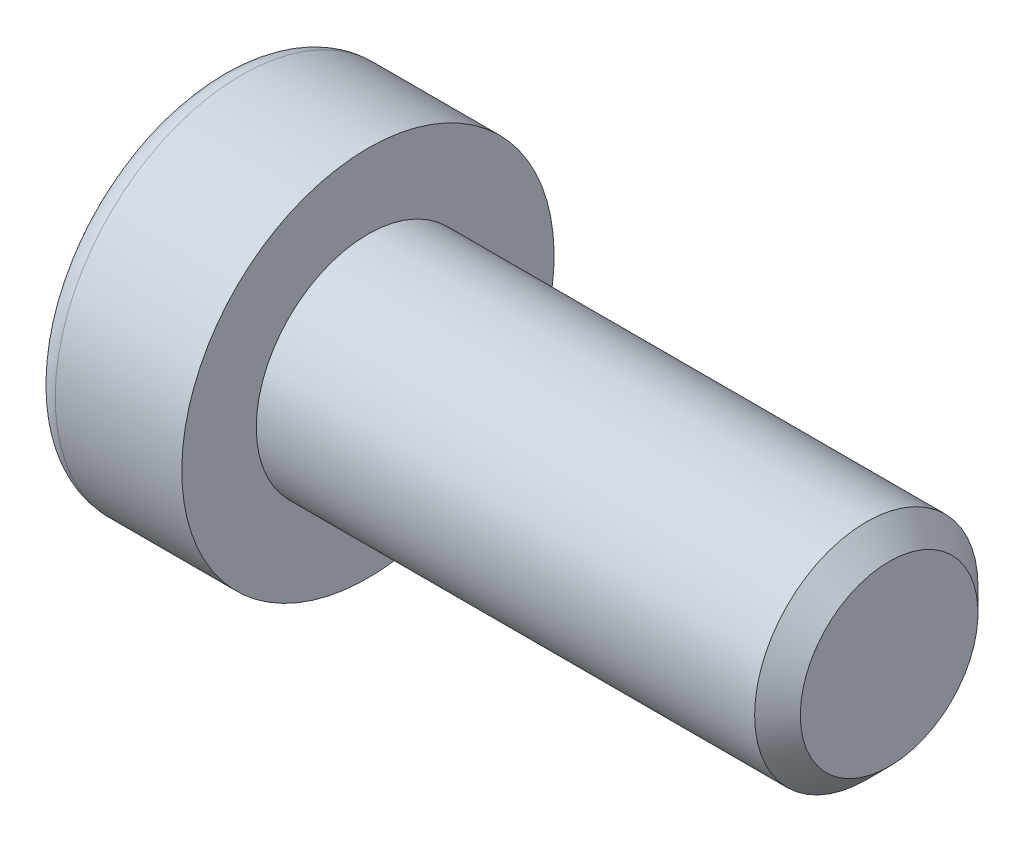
ISO-10303-21;
HEADER;
FILE_DESCRIPTION(('STEP AP214'),'2;1');
FILE_NAME('part.step','',(''),(''),'','','');
FILE_SCHEMA(('AUTOMOTIVE_DESIGN { 1 0 10303 214 1 1 1 1 }'));
ENDSEC;
DATA;
#1=APPLICATION_CONTEXT('core data for automotive mechanical design processes');
#2=APPLICATION_PROTOCOL_DEFINITION('international standard','automotive_design',2000,#1);
#3=PRODUCT_CONTEXT('',#1,'mechanical');
#4=PRODUCT('Part','Part','',(#3));
#5=PRODUCT_RELATED_PRODUCT_CATEGORY('part','',(#4));
#6=PRODUCT_DEFINITION_FORMATION('','',#4);
#7=PRODUCT_DEFINITION_CONTEXT('part definition',#1,'design');
#8=PRODUCT_DEFINITION('design','',#6,#7);
#9=PRODUCT_DEFINITION_SHAPE('','',#8);
#10=(LENGTH_UNIT() NAMED_UNIT(*) SI_UNIT(.MILLI.,.METRE.));
#11=(NAMED_UNIT(*) PLANE_ANGLE_UNIT() SI_UNIT($,.RADIAN.));
#12=(NAMED_UNIT(*) SI_UNIT($,.STERADIAN.) SOLID_ANGLE_UNIT());
#13=UNCERTAINTY_MEASURE_WITH_UNIT(LENGTH_MEASURE(1.E-05),#10,'distance_accuracy_value','');
#14=(GEOMETRIC_REPRESENTATION_CONTEXT(3) GLOBAL_UNCERTAINTY_ASSIGNED_CONTEXT((#13)) GLOBAL_UNIT_ASSIGNED_CONTEXT((#10,
#11,#12)) REPRESENTATION_CONTEXT('',''));
#15=CARTESIAN_POINT('',(0.,0.,0.));
#16=DIRECTION('',(0.,0.,1.));
#17=DIRECTION('',(1.,0.,0.));
#18=AXIS2_PLACEMENT_3D('',#15,#16,#17);
#19=CARTESIAN_POINT('',(-1.00800000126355,0.,0.));
#20=DIRECTION('',(-1.,0.,0.));
#21=DIRECTION('',(0.,0.,1.));
#22=AXIS2_PLACEMENT_3D('',#19,#20,#21);
#23=CONICAL_SURFACE('',#22,2.32325748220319,1.04719754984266);
#24=CARTESIAN_POINT('',(0.333333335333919,-2.27373675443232E-10,0.));
#25=VERTEX_POINT('',#24);
#26=VERTEX_LOOP('',#25);
#27=FACE_BOUND('',#26,.T.);
#28=CARTESIAN_POINT('',(-1.00000000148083,2.00000000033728,1.15470053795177));
#29=CARTESIAN_POINT('',(-0.970695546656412,2.00000000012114,1.05321634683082));
#30=CARTESIAN_POINT('',(-0.944044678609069,2.00000000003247,0.950856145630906));
#31=CARTESIAN_POINT('',(-0.897526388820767,1.99999999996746,0.744363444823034));
#32=CARTESIAN_POINT('',(-0.877675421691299,1.99999999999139,0.640227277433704));
#33=CARTESIAN_POINT('',(-0.84677596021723,2.0000000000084,0.43324544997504));
#34=CARTESIAN_POINT('',(-0.835521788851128,2.00000000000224,0.330431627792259));
#35=CARTESIAN_POINT('',(-0.822089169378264,1.99999999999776,0.124320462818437));
#36=CARTESIAN_POINT('',(-0.819899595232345,1.99999999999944,0.0210238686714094));
#37=CARTESIAN_POINT('',(-0.824466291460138,2.00000000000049,-0.171974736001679));
#38=CARTESIAN_POINT('',(-0.830101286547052,2.00000000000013,-0.261705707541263));
#39=CARTESIAN_POINT('',(-0.847957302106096,1.99999999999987,-0.440583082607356));
#40=CARTESIAN_POINT('',(-0.86018441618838,1.99999999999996,-0.529728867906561));
#41=CARTESIAN_POINT('',(-0.890749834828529,2.00000000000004,-0.708974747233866));
#42=CARTESIAN_POINT('',(-0.909217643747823,2.00000000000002,-0.799052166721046));
#43=CARTESIAN_POINT('',(-0.95113176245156,1.99999999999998,-0.977863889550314));
#44=CARTESIAN_POINT('',(-0.974568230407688,1.99999999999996,-1.06660048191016));
#45=CARTESIAN_POINT('',(-1.00000000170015,2.,-1.15470053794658));
#46=B_SPLINE_CURVE_WITH_KNOTS('',3,(#28,#29,#30,#31,#32,#33,#34,#35,#36,#37,#38,#39,#40,#41,#42,
#43,#44,#45),.UNSPECIFIED.,.F.,.F.,(4,2,2,2,2,2,2,2,4),(0.,0.317016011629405,0.634793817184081,
0.944707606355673,1.25424088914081,1.52370778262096,1.79342419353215,2.06912162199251,
2.34427797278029),.UNSPECIFIED.);
#47=CARTESIAN_POINT('',(-1.00000000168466,1.99999999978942,1.15470053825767));
#48=VERTEX_POINT('',#47);
#49=CARTESIAN_POINT('',(-1.00000000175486,2.,-1.15470053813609));
#50=VERTEX_POINT('',#49);
#51=EDGE_CURVE('E20',#48,#50,#46,.T.);
#52=ORIENTED_EDGE('',*,*,#51,.T.);
#53=CARTESIAN_POINT('',(-1.00000000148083,1.99999999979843,-1.15470053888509));
#54=CARTESIAN_POINT('',(-0.970695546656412,1.91211211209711,-1.20544263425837));
#55=CARTESIAN_POINT('',(-0.94404467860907,1.82346557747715,-1.25662273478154));
#56=CARTESIAN_POINT('',(-0.897526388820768,1.64463765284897,-1.35986908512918));
#57=CARTESIAN_POINT('',(-0.877675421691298,1.55445308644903,-1.41193716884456));
#58=CARTESIAN_POINT('',(-0.84677596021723,1.37520156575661,-1.51542808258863));
#59=CARTESIAN_POINT('',(-0.835521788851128,1.28616218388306,-1.56683499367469));
#60=CARTESIAN_POINT('',(-0.822089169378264,1.10766467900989,-1.66989057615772));
#61=CARTESIAN_POINT('',(-0.819899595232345,1.01820720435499,-1.72153887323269));
#62=CARTESIAN_POINT('',(-0.824466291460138,0.851065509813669,-1.81803817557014));
#63=CARTESIAN_POINT('',(-0.830101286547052,0.773356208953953,-1.86290366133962));
#64=CARTESIAN_POINT('',(-0.847957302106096,0.618443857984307,-1.95234234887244));
#65=CARTESIAN_POINT('',(-0.860184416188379,0.541241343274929,-1.99691524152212));
#66=CARTESIAN_POINT('',(-0.890749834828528,0.386009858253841,-2.08653818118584));
#67=CARTESIAN_POINT('',(-0.909217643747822,0.308000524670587,-2.13157689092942));
#68=CARTESIAN_POINT('',(-0.95113176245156,0.153145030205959,-2.22098275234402));
#69=CARTESIAN_POINT('',(-0.974568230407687,0.076296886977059,-2.26535104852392));
#70=CARTESIAN_POINT('',(-1.00000000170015,3.74709208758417E-10,-2.30940107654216));
#71=B_SPLINE_CURVE_WITH_KNOTS('',3,(#53,#54,#55,#56,#57,#58,#59,#60,#61,#62,#63,#64,#65,#66,#67,
#68,#69,#70),.UNSPECIFIED.,.F.,.F.,(4,2,2,2,2,2,2,2,4),(0.,0.317016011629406,0.634793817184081,
0.944707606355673,1.25424088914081,1.52370778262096,1.79342419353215,2.06912162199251,
2.34427797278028),.UNSPECIFIED.);
#72=CARTESIAN_POINT('',(-1.00000000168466,0.,-2.30940107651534));
#73=VERTEX_POINT('',#72);
#74=EDGE_CURVE('E81',#50,#73,#71,.T.);
#75=ORIENTED_EDGE('',*,*,#74,.T.);
#76=CARTESIAN_POINT('',(-1.00000000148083,-5.38850513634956E-10,-2.30940107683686));
#77=CARTESIAN_POINT('',(-0.970695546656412,-0.0878878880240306,-2.2586589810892));
#78=CARTESIAN_POINT('',(-0.944044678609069,-0.176534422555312,-2.20747888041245));
#79=CARTESIAN_POINT('',(-0.897526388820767,-0.355362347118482,-2.10423252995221));
#80=CARTESIAN_POINT('',(-0.877675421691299,-0.445546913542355,-2.05216444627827));
#81=CARTESIAN_POINT('',(-0.84677596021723,-0.624798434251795,-1.94867353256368));
#82=CARTESIAN_POINT('',(-0.835521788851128,-0.713837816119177,-1.89726662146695));
#83=CARTESIAN_POINT('',(-0.822089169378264,-0.892335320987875,-1.79421103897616));
#84=CARTESIAN_POINT('',(-0.819899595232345,-0.981792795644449,-1.7425627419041));
#85=CARTESIAN_POINT('',(-0.824466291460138,-1.14893449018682,-1.64606343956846));
#86=CARTESIAN_POINT('',(-0.830101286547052,-1.22664379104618,-1.60119795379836));
#87=CARTESIAN_POINT('',(-0.847957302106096,-1.38155614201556,-1.51175926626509));
#88=CARTESIAN_POINT('',(-0.860184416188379,-1.45875865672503,-1.46718637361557));
#89=CARTESIAN_POINT('',(-0.890749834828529,-1.6139901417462,-1.37756343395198));
#90=CARTESIAN_POINT('',(-0.909217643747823,-1.69199947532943,-1.33252472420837));
#91=CARTESIAN_POINT('',(-0.95113176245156,-1.84685496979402,-1.2431188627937));
#92=CARTESIAN_POINT('',(-0.974568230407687,-1.9237031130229,-1.19875056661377));
#93=CARTESIAN_POINT('',(-1.00000000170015,-1.99999999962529,-1.15470053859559));
#94=B_SPLINE_CURVE_WITH_KNOTS('',3,(#76,#77,#78,#79,#80,#81,#82,#83,#84,#85,#86,#87,#88,#89,#90,
#91,#92,#93),.UNSPECIFIED.,.F.,.F.,(4,2,2,2,2,2,2,2,4),(0.,0.317016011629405,0.63479381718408,
0.944707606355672,1.25424088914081,1.52370778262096,1.79342419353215,2.06912162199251,
2.34427797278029),.UNSPECIFIED.);
#95=CARTESIAN_POINT('',(-1.00000000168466,-1.99999999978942,-1.15470053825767));
#96=VERTEX_POINT('',#95);
#97=EDGE_CURVE('E106',#73,#96,#94,.T.);
#98=ORIENTED_EDGE('',*,*,#97,.T.);
#99=CARTESIAN_POINT('',(-1.00000000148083,-2.00000000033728,-1.15470053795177));
#100=CARTESIAN_POINT('',(-0.970695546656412,-2.00000000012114,-1.05321634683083));
#101=CARTESIAN_POINT('',(-0.944044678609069,-2.00000000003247,-0.950856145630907));
#102=CARTESIAN_POINT('',(-0.897526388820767,-1.99999999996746,-0.744363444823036));
#103=CARTESIAN_POINT('',(-0.877675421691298,-1.99999999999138,-0.640227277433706));
#104=CARTESIAN_POINT('',(-0.84677596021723,-2.0000000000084,-0.433245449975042));
#105=CARTESIAN_POINT('',(-0.835521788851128,-2.00000000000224,-0.330431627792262));
#106=CARTESIAN_POINT('',(-0.822089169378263,-1.99999999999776,-0.124320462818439));
#107=CARTESIAN_POINT('',(-0.819899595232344,-1.99999999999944,-0.0210238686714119));
#108=CARTESIAN_POINT('',(-0.824466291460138,-2.00000000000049,0.171974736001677));
#109=CARTESIAN_POINT('',(-0.830101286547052,-2.00000000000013,0.26170570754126));
#110=CARTESIAN_POINT('',(-0.847957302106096,-1.99999999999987,0.440583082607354));
#111=CARTESIAN_POINT('',(-0.860184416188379,-1.99999999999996,0.529728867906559));
#112=CARTESIAN_POINT('',(-0.890749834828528,-2.00000000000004,0.708974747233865));
#113=CARTESIAN_POINT('',(-0.909217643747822,-2.00000000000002,0.799052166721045));
#114=CARTESIAN_POINT('',(-0.951131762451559,-1.99999999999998,0.977863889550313));
#115=CARTESIAN_POINT('',(-0.974568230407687,-1.99999999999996,1.06660048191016));
#116=CARTESIAN_POINT('',(-1.00000000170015,-2.,1.15470053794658));
#117=B_SPLINE_CURVE_WITH_KNOTS('',3,(#99,#100,#101,#102,#103,#104,#105,#106,#107,#108,#109,#110,
#111,#112,#113,#114,#115,#116),.UNSPECIFIED.,.F.,.F.,(4,2,2,2,2,2,2,2,4),(0.,0.317016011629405,
0.63479381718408,0.944707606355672,1.25424088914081,1.52370778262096,1.79342419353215,
2.06912162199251,2.34427797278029),.UNSPECIFIED.);
#118=CARTESIAN_POINT('',(-1.00000000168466,-1.99999999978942,1.15470053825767));
#119=VERTEX_POINT('',#118);
#120=EDGE_CURVE('E130',#96,#119,#117,.T.);
#121=ORIENTED_EDGE('',*,*,#120,.T.);
#122=CARTESIAN_POINT('',(-1.00000000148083,-1.99999999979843,1.15470053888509));
#123=CARTESIAN_POINT('',(-0.970695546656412,-1.91211211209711,1.20544263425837));
#124=CARTESIAN_POINT('',(-0.94404467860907,-1.82346557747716,1.25662273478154));
#125=CARTESIAN_POINT('',(-0.897526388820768,-1.64463765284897,1.35986908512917));
#126=CARTESIAN_POINT('',(-0.877675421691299,-1.55445308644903,1.41193716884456));
#127=CARTESIAN_POINT('',(-0.84677596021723,-1.37520156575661,1.51542808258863));
#128=CARTESIAN_POINT('',(-0.835521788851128,-1.28616218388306,1.56683499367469));
#129=CARTESIAN_POINT('',(-0.822089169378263,-1.10766467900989,1.66989057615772));
#130=CARTESIAN_POINT('',(-0.819899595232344,-1.01820720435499,1.72153887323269));
#131=CARTESIAN_POINT('',(-0.824466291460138,-0.85106550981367,1.81803817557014));
#132=CARTESIAN_POINT('',(-0.830101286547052,-0.773356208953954,1.86290366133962));
#133=CARTESIAN_POINT('',(-0.847957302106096,-0.618443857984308,1.95234234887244));
#134=CARTESIAN_POINT('',(-0.860184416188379,-0.54124134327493,1.99691524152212));
#135=CARTESIAN_POINT('',(-0.890749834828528,-0.386009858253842,2.08653818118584));
#136=CARTESIAN_POINT('',(-0.909217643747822,-0.308000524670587,2.13157689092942));
#137=CARTESIAN_POINT('',(-0.951131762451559,-0.153145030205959,2.22098275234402));
#138=CARTESIAN_POINT('',(-0.974568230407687,-0.076296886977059,2.26535104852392));
#139=CARTESIAN_POINT('',(-1.00000000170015,-3.74708969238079E-10,2.30940107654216));
#140=B_SPLINE_CURVE_WITH_KNOTS('',3,(#122,#123,#124,#125,#126,#127,#128,#129,#130,#131,#132,
#133,#134,#135,#136,#137,#138,#139),.UNSPECIFIED.,.F.,.F.,(4,2,2,2,2,2,2,2,4),(0.,
0.317016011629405,0.63479381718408,0.944707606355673,1.25424088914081,1.52370778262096,
1.79342419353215,2.06912162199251,2.34427797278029),.UNSPECIFIED.);
#141=CARTESIAN_POINT('',(-1.00000000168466,0.,2.30940107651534));
#142=VERTEX_POINT('',#141);
#143=EDGE_CURVE('E138',#119,#142,#140,.T.);
#144=ORIENTED_EDGE('',*,*,#143,.T.);
#145=CARTESIAN_POINT('',(-1.00000000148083,5.38850492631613E-10,2.30940107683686));
#146=CARTESIAN_POINT('',(-0.970695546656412,0.0878878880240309,2.2586589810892));
#147=CARTESIAN_POINT('',(-0.944044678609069,0.176534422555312,2.20747888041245));
#148=CARTESIAN_POINT('',(-0.897526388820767,0.355362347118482,2.10423252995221));
#149=CARTESIAN_POINT('',(-0.877675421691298,0.445546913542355,2.05216444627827));
#150=CARTESIAN_POINT('',(-0.846775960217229,0.624798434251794,1.94867353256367));
#151=CARTESIAN_POINT('',(-0.835521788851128,0.713837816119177,1.89726662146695));
#152=CARTESIAN_POINT('',(-0.822089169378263,0.892335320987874,1.79421103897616));
#153=CARTESIAN_POINT('',(-0.819899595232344,0.981792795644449,1.7425627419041));
#154=CARTESIAN_POINT('',(-0.824466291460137,1.14893449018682,1.64606343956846));
#155=CARTESIAN_POINT('',(-0.830101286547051,1.22664379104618,1.60119795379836));
#156=CARTESIAN_POINT('',(-0.847957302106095,1.38155614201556,1.51175926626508));
#157=CARTESIAN_POINT('',(-0.860184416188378,1.45875865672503,1.46718637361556));
#158=CARTESIAN_POINT('',(-0.890749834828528,1.6139901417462,1.37756343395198));
#159=CARTESIAN_POINT('',(-0.909217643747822,1.69199947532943,1.33252472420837));
#160=CARTESIAN_POINT('',(-0.951131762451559,1.84685496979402,1.2431188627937));
#161=CARTESIAN_POINT('',(-0.974568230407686,1.9237031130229,1.19875056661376));
#162=CARTESIAN_POINT('',(-1.00000000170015,1.99999999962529,1.15470053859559));
#163=B_SPLINE_CURVE_WITH_KNOTS('',3,(#145,#146,#147,#148,#149,#150,#151,#152,#153,#154,#155,
#156,#157,#158,#159,#160,#161,#162),.UNSPECIFIED.,.F.,.F.,(4,2,2,2,2,2,2,2,4),(0.,
0.317016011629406,0.63479381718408,0.944707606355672,1.25424088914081,1.52370778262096,
1.79342419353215,2.06912162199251,2.34427797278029),.UNSPECIFIED.);
#164=EDGE_CURVE('E83',#142,#48,#163,.T.);
#165=ORIENTED_EDGE('',*,*,#164,.T.);
#166=EDGE_LOOP('',(#52,#75,#98,#121,#144,#165));
#167=FACE_BOUND('',#166,.T.);
#168=ADVANCED_FACE('F16',(#27,#167),#23,.F.);
#169=CARTESIAN_POINT('',(-3.99999999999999,2.,1.15470053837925));
#170=DIRECTION('',(0.,1.,0.));
#171=DIRECTION('',(0.,0.,1.));
#172=AXIS2_PLACEMENT_3D('',#169,#170,#171);
#173=PLANE('',#172);
#174=DIRECTION('',(1.,0.,0.));
#175=VECTOR('',#174,1.);
#176=CARTESIAN_POINT('',(-3.99999999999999,2.,1.15470053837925));
#177=LINE('',#176,#175);
#178=CARTESIAN_POINT('',(-3.99999999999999,2.,1.15470053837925));
#179=VERTEX_POINT('',#178);
#180=EDGE_CURVE('E85',#48,#179,#177,.F.);
#181=ORIENTED_EDGE('',*,*,#180,.T.);
#182=DIRECTION('',(0.,0.,1.));
#183=VECTOR('',#182,1.);
#184=CARTESIAN_POINT('',(-3.99999999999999,2.,0.));
#185=LINE('',#184,#183);
#186=CARTESIAN_POINT('',(-3.99999999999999,2.,-1.15470053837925));
#187=VERTEX_POINT('',#186);
#188=EDGE_CURVE('E90',#187,#179,#185,.T.);
#189=ORIENTED_EDGE('',*,*,#188,.F.);
#190=DIRECTION('',(1.,0.,0.));
#191=VECTOR('',#190,1.);
#192=CARTESIAN_POINT('',(-3.99999999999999,2.,-1.15470053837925));
#193=LINE('',#192,#191);
#194=EDGE_CURVE('E88',#187,#50,#193,.T.);
#195=ORIENTED_EDGE('',*,*,#194,.T.);
#196=ORIENTED_EDGE('',*,*,#51,.F.);
#197=EDGE_LOOP('',(#181,#189,#195,#196));
#198=FACE_BOUND('',#197,.T.);
#199=ADVANCED_FACE('F77',(#198),#173,.F.);
#200=CARTESIAN_POINT('',(-3.99999999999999,0.,2.3094010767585));
#201=DIRECTION('',(0.,0.500000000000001,0.866025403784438));
#202=DIRECTION('',(0.,-0.866025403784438,0.500000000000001));
#203=AXIS2_PLACEMENT_3D('',#200,#201,#202);
#204=PLANE('',#203);
#205=DIRECTION('',(1.,0.,0.));
#206=VECTOR('',#205,1.);
#207=CARTESIAN_POINT('',(-3.99999999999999,0.,2.3094010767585));
#208=LINE('',#207,#206);
#209=CARTESIAN_POINT('',(-3.99999999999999,0.,2.3094010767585));
#210=VERTEX_POINT('',#209);
#211=EDGE_CURVE('E142',#142,#210,#208,.F.);
#212=ORIENTED_EDGE('',*,*,#211,.T.);
#213=DIRECTION('',(0.,-0.866025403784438,0.500000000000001));
#214=VECTOR('',#213,1.);
#215=CARTESIAN_POINT('',(-3.99999999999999,2.,1.15470053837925));
#216=LINE('',#215,#214);
#217=EDGE_CURVE('E96',#179,#210,#216,.T.);
#218=ORIENTED_EDGE('',*,*,#217,.F.);
#219=ORIENTED_EDGE('',*,*,#180,.F.);
#220=ORIENTED_EDGE('',*,*,#164,.F.);
#221=EDGE_LOOP('',(#212,#218,#219,#220));
#222=FACE_BOUND('',#221,.T.);
#223=ADVANCED_FACE('F146',(#222),#204,.F.);
#224=CARTESIAN_POINT('',(-3.99999999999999,-2.,1.15470053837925));
#225=DIRECTION('',(0.,-0.5,0.866025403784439));
#226=DIRECTION('',(0.,-0.866025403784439,-0.5));
#227=AXIS2_PLACEMENT_3D('',#224,#225,#226);
#228=PLANE('',#227);
#229=DIRECTION('',(1.,0.,0.));
#230=VECTOR('',#229,1.);
#231=CARTESIAN_POINT('',(-3.99999999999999,-2.,1.15470053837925));
#232=LINE('',#231,#230);
#233=CARTESIAN_POINT('',(-3.99999999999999,-2.,1.15470053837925));
#234=VERTEX_POINT('',#233);
#235=EDGE_CURVE('E137',#119,#234,#232,.F.);
#236=ORIENTED_EDGE('',*,*,#235,.T.);
#237=DIRECTION('',(0.,-0.866025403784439,-0.5));
#238=VECTOR('',#237,1.);
#239=CARTESIAN_POINT('',(-3.99999999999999,0.,2.3094010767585));
#240=LINE('',#239,#238);
#241=EDGE_CURVE('E225',#210,#234,#240,.T.);
#242=ORIENTED_EDGE('',*,*,#241,.F.);
#243=ORIENTED_EDGE('',*,*,#211,.F.);
#244=ORIENTED_EDGE('',*,*,#143,.F.);
#245=EDGE_LOOP('',(#236,#242,#243,#244));
#246=FACE_BOUND('',#245,.T.);
#247=ADVANCED_FACE('F126',(#246),#228,.F.);
#248=CARTESIAN_POINT('',(-3.99999999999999,-2.,-1.15470053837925));
#249=DIRECTION('',(0.,-1.,0.));
#250=DIRECTION('',(0.,0.,-1.));
#251=AXIS2_PLACEMENT_3D('',#248,#249,#250);
#252=PLANE('',#251);
#253=DIRECTION('',(1.,0.,0.));
#254=VECTOR('',#253,1.);
#255=CARTESIAN_POINT('',(-3.99999999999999,-2.,-1.15470053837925));
#256=LINE('',#255,#254);
#257=CARTESIAN_POINT('',(-3.99999999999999,-2.,-1.15470053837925));
#258=VERTEX_POINT('',#257);
#259=EDGE_CURVE('E136',#96,#258,#256,.F.);
#260=ORIENTED_EDGE('',*,*,#259,.T.);
#261=DIRECTION('',(0.,0.,1.));
#262=VECTOR('',#261,1.);
#263=CARTESIAN_POINT('',(-3.99999999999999,-2.,0.));
#264=LINE('',#263,#262);
#265=EDGE_CURVE('E222',#234,#258,#264,.F.);
#266=ORIENTED_EDGE('',*,*,#265,.F.);
#267=ORIENTED_EDGE('',*,*,#235,.F.);
#268=ORIENTED_EDGE('',*,*,#120,.F.);
#269=EDGE_LOOP('',(#260,#266,#267,#268));
#270=FACE_BOUND('',#269,.T.);
#271=ADVANCED_FACE('F122',(#270),#252,.F.);
#272=CARTESIAN_POINT('',(-3.99999999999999,0.,-2.3094010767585));
#273=DIRECTION('',(0.,-0.5,-0.866025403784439));
#274=DIRECTION('',(0.,0.866025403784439,-0.5));
#275=AXIS2_PLACEMENT_3D('',#272,#273,#274);
#276=PLANE('',#275);
#277=DIRECTION('',(1.,0.,0.));
#278=VECTOR('',#277,1.);
#279=CARTESIAN_POINT('',(-3.99999999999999,0.,-2.3094010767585));
#280=LINE('',#279,#278);
#281=CARTESIAN_POINT('',(-3.99999999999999,0.,-2.3094010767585));
#282=VERTEX_POINT('',#281);
#283=EDGE_CURVE('E39',#73,#282,#280,.F.);
#284=ORIENTED_EDGE('',*,*,#283,.T.);
#285=DIRECTION('',(0.,0.866025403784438,-0.5));
#286=VECTOR('',#285,1.);
#287=CARTESIAN_POINT('',(-3.99999999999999,-2.,-1.15470053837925));
#288=LINE('',#287,#286);
#289=EDGE_CURVE('E219',#258,#282,#288,.T.);
#290=ORIENTED_EDGE('',*,*,#289,.F.);
#291=ORIENTED_EDGE('',*,*,#259,.F.);
#292=ORIENTED_EDGE('',*,*,#97,.F.);
#293=EDGE_LOOP('',(#284,#290,#291,#292));
#294=FACE_BOUND('',#293,.T.);
#295=ADVANCED_FACE('F116',(#294),#276,.F.);
#296=CARTESIAN_POINT('',(-3.99999999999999,2.,-1.15470053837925));
#297=DIRECTION('',(0.,0.5,-0.866025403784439));
#298=DIRECTION('',(0.,0.866025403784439,0.5));
#299=AXIS2_PLACEMENT_3D('',#296,#297,#298);
#300=PLANE('',#299);
#301=ORIENTED_EDGE('',*,*,#194,.F.);
#302=DIRECTION('',(0.,0.866025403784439,0.5));
#303=VECTOR('',#302,1.);
#304=CARTESIAN_POINT('',(-3.99999999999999,0.,-2.3094010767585));
#305=LINE('',#304,#303);
#306=EDGE_CURVE('E217',#282,#187,#305,.T.);
#307=ORIENTED_EDGE('',*,*,#306,.F.);
#308=ORIENTED_EDGE('',*,*,#283,.F.);
#309=ORIENTED_EDGE('',*,*,#74,.F.);
#310=EDGE_LOOP('',(#301,#307,#308,#309));
#311=FACE_BOUND('',#310,.T.);
#312=ADVANCED_FACE('F94',(#311),#300,.F.);
#313=CARTESIAN_POINT('',(-3.99999999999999,3.65470053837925,0.));
#314=DIRECTION('',(-1.,0.,0.));
#315=DIRECTION('',(0.,0.,1.));
#316=AXIS2_PLACEMENT_3D('',#313,#314,#315);
#317=PLANE('',#316);
#318=ORIENTED_EDGE('',*,*,#289,.T.);
#319=ORIENTED_EDGE('',*,*,#306,.T.);
#320=ORIENTED_EDGE('',*,*,#188,.T.);
#321=ORIENTED_EDGE('',*,*,#217,.T.);
#322=ORIENTED_EDGE('',*,*,#241,.T.);
#323=ORIENTED_EDGE('',*,*,#265,.T.);
#324=EDGE_LOOP('',(#318,#319,#320,#321,#322,#323));
#325=FACE_BOUND('',#324,.T.);
#326=CARTESIAN_POINT('',(-3.99999999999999,0.,0.));
#327=DIRECTION('',(1.,0.,0.));
#328=DIRECTION('',(0.,1.,0.));
#329=AXIS2_PLACEMENT_3D('',#326,#327,#328);
#330=CIRCLE('',#329,4.4);
#331=CARTESIAN_POINT('',(-3.99999999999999,4.4,0.));
#332=VERTEX_POINT('',#331);
#333=EDGE_CURVE('E194',#332,#332,#330,.T.);
#334=ORIENTED_EDGE('',*,*,#333,.F.);
#335=EDGE_LOOP('',(#334));
#336=FACE_BOUND('',#335,.T.);
#337=ADVANCED_FACE('F115',(#325,#336),#317,.T.);
#338=CARTESIAN_POINT('',(-3.4,0.,0.));
#339=DIRECTION('',(1.,0.,0.));
#340=DIRECTION('',(0.,0.,-1.));
#341=AXIS2_PLACEMENT_3D('',#338,#339,#340);
#342=TOROIDAL_SURFACE('',#341,4.4,0.6);
#343=CARTESIAN_POINT('',(-3.4,0.,0.));
#344=DIRECTION('',(1.,0.,0.));
#345=DIRECTION('',(0.,1.,0.));
#346=AXIS2_PLACEMENT_3D('',#343,#344,#345);
#347=CIRCLE('',#346,5.);
#348=CARTESIAN_POINT('',(-3.4,5.,0.));
#349=VERTEX_POINT('',#348);
#350=EDGE_CURVE('E237',#349,#349,#347,.T.);
#351=ORIENTED_EDGE('',*,*,#350,.F.);
#352=EDGE_LOOP('',(#351));
#353=FACE_BOUND('',#352,.T.);
#354=ORIENTED_EDGE('',*,*,#333,.T.);
#355=EDGE_LOOP('',(#354));
#356=FACE_BOUND('',#355,.T.);
#357=ADVANCED_FACE('F178',(#353,#356),#342,.T.);
#358=CARTESIAN_POINT('',(-2.,0.,0.));
#359=DIRECTION('',(1.,0.,0.));
#360=DIRECTION('',(0.,1.,0.));
#361=AXIS2_PLACEMENT_3D('',#358,#359,#360);
#362=CYLINDRICAL_SURFACE('',#361,5.);
#363=ORIENTED_EDGE('',*,*,#350,.T.);
#364=EDGE_LOOP('',(#363));
#365=FACE_BOUND('',#364,.T.);
#366=CARTESIAN_POINT('',(0.,0.,0.));
#367=DIRECTION('',(1.,0.,0.));
#368=DIRECTION('',(0.,1.,0.));
#369=AXIS2_PLACEMENT_3D('',#366,#367,#368);
#370=CIRCLE('',#369,5.);
#371=CARTESIAN_POINT('',(0.,5.,0.));
#372=VERTEX_POINT('',#371);
#373=EDGE_CURVE('E104',#372,#372,#370,.T.);
#374=ORIENTED_EDGE('',*,*,#373,.F.);
#375=EDGE_LOOP('',(#374));
#376=FACE_BOUND('',#375,.T.);
#377=ADVANCED_FACE('F175',(#365,#376),#362,.T.);
#378=CARTESIAN_POINT('',(14.,1.5,0.));
#379=DIRECTION('',(1.,0.,0.));
#380=DIRECTION('',(0.,0.,-1.));
#381=AXIS2_PLACEMENT_3D('',#378,#379,#380);
#382=PLANE('',#381);
#383=CARTESIAN_POINT('',(14.0000000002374,0.,0.));
#384=DIRECTION('',(-1.,0.,0.));
#385=DIRECTION('',(0.,0.,1.));
#386=AXIS2_PLACEMENT_3D('',#383,#384,#385);
#387=CIRCLE('',#386,2.38655000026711);
#388=CARTESIAN_POINT('',(14.0000000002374,0.,2.38655000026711));
#389=VERTEX_POINT('',#388);
#390=EDGE_CURVE('E231',#389,#389,#387,.T.);
#391=ORIENTED_EDGE('',*,*,#390,.F.);
#392=EDGE_LOOP('',(#391));
#393=FACE_BOUND('',#392,.T.);
#394=ADVANCED_FACE('F171',(#393),#382,.T.);
#395=CARTESIAN_POINT('',(0.,4.,0.));
#396=DIRECTION('',(1.,0.,0.));
#397=DIRECTION('',(0.,0.,-1.));
#398=AXIS2_PLACEMENT_3D('',#395,#396,#397);
#399=PLANE('',#398);
#400=CARTESIAN_POINT('',(0.,0.,0.));
#401=DIRECTION('',(1.,0.,0.));
#402=DIRECTION('',(0.,1.,0.));
#403=AXIS2_PLACEMENT_3D('',#400,#401,#402);
#404=CIRCLE('',#403,3.);
#405=CARTESIAN_POINT('',(0.,3.,0.));
#406=VERTEX_POINT('',#405);
#407=EDGE_CURVE('E30',#406,#406,#404,.T.);
#408=ORIENTED_EDGE('',*,*,#407,.F.);
#409=EDGE_LOOP('',(#408));
#410=FACE_BOUND('',#409,.T.);
#411=ORIENTED_EDGE('',*,*,#373,.T.);
#412=EDGE_LOOP('',(#411));
#413=FACE_BOUND('',#412,.T.);
#414=ADVANCED_FACE('F164',(#410,#413),#399,.T.);
#415=CARTESIAN_POINT('',(13.3865499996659,0.,0.));
#416=DIRECTION('',(-1.,0.,0.));
#417=DIRECTION('',(0.,0.,1.));
#418=AXIS2_PLACEMENT_3D('',#415,#416,#417);
#419=CONICAL_SURFACE('',#418,2.99999999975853,0.785398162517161);
#420=ORIENTED_EDGE('',*,*,#390,.T.);
#421=EDGE_LOOP('',(#420));
#422=FACE_BOUND('',#421,.T.);
#423=CARTESIAN_POINT('',(13.38655,0.,0.));
#424=DIRECTION('',(1.,0.,0.));
#425=DIRECTION('',(0.,1.,0.));
#426=AXIS2_PLACEMENT_3D('',#423,#424,#425);
#427=CIRCLE('',#426,3.);
#428=CARTESIAN_POINT('',(13.38655,3.,0.));
#429=VERTEX_POINT('',#428);
#430=EDGE_CURVE('E11',#429,#429,#427,.F.);
#431=ORIENTED_EDGE('',*,*,#430,.F.);
#432=EDGE_LOOP('',(#431));
#433=FACE_BOUND('',#432,.T.);
#434=ADVANCED_FACE('F157',(#422,#433),#419,.T.);
#435=CARTESIAN_POINT('',(7.5,0.,0.));
#436=DIRECTION('',(1.,0.,0.));
#437=DIRECTION('',(0.,1.,0.));
#438=AXIS2_PLACEMENT_3D('',#435,#436,#437);
#439=CYLINDRICAL_SURFACE('',#438,3.);
#440=ORIENTED_EDGE('',*,*,#430,.T.);
#441=EDGE_LOOP('',(#440));
#442=FACE_BOUND('',#441,.T.);
#443=ORIENTED_EDGE('',*,*,#407,.T.);
#444=EDGE_LOOP('',(#443));
#445=FACE_BOUND('',#444,.T.);
#446=ADVANCED_FACE('F155',(#442,#445),#439,.T.);
#447=CLOSED_SHELL('',(#168,#199,#223,#247,#271,#295,#312,#337,#357,#377,#394,#414,#434,#446));
#448=MANIFOLD_SOLID_BREP('B1',#447);
#449=ADVANCED_BREP_SHAPE_REPRESENTATION('',(#18,#448),#14);
#450=SHAPE_DEFINITION_REPRESENTATION(#9,#449);
ENDSEC;
END-ISO-10303-21;
